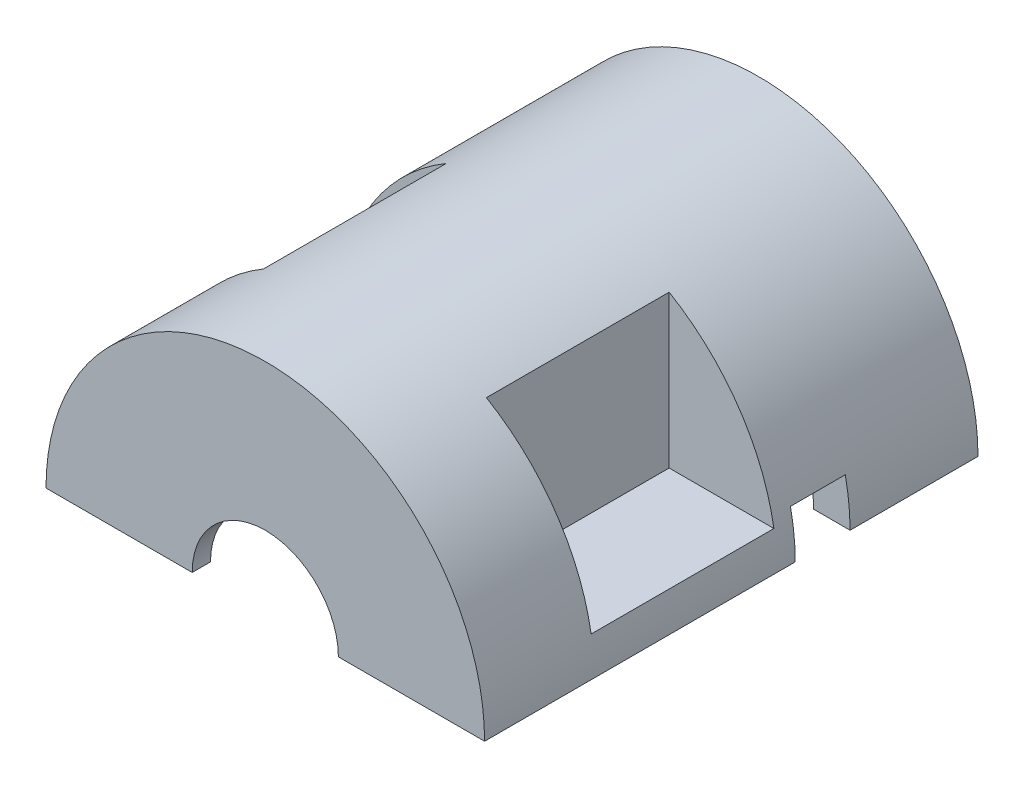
ISO-10303-21;
HEADER;
FILE_DESCRIPTION(('STEP AP214'),'2;1');
FILE_NAME('part.step','',(''),(''),'','','');
FILE_SCHEMA(('AUTOMOTIVE_DESIGN { 1 0 10303 214 1 1 1 1 }'));
ENDSEC;
DATA;
#1=APPLICATION_CONTEXT('core data for automotive mechanical design processes');
#2=APPLICATION_PROTOCOL_DEFINITION('international standard','automotive_design',2000,#1);
#3=PRODUCT_CONTEXT('',#1,'mechanical');
#4=PRODUCT('Part','Part','',(#3));
#5=PRODUCT_RELATED_PRODUCT_CATEGORY('part','',(#4));
#6=PRODUCT_DEFINITION_FORMATION('','',#4);
#7=PRODUCT_DEFINITION_CONTEXT('part definition',#1,'design');
#8=PRODUCT_DEFINITION('design','',#6,#7);
#9=PRODUCT_DEFINITION_SHAPE('','',#8);
#10=(LENGTH_UNIT() NAMED_UNIT(*) SI_UNIT(.MILLI.,.METRE.));
#11=(NAMED_UNIT(*) PLANE_ANGLE_UNIT() SI_UNIT($,.RADIAN.));
#12=(NAMED_UNIT(*) SI_UNIT($,.STERADIAN.) SOLID_ANGLE_UNIT());
#13=UNCERTAINTY_MEASURE_WITH_UNIT(LENGTH_MEASURE(1.E-05),#10,'distance_accuracy_value','');
#14=(GEOMETRIC_REPRESENTATION_CONTEXT(3) GLOBAL_UNCERTAINTY_ASSIGNED_CONTEXT((#13)) GLOBAL_UNIT_ASSIGNED_CONTEXT((#10,
#11,#12)) REPRESENTATION_CONTEXT('',''));
#15=CARTESIAN_POINT('',(0.,0.,0.));
#16=DIRECTION('',(0.,0.,1.));
#17=DIRECTION('',(1.,0.,0.));
#18=AXIS2_PLACEMENT_3D('',#15,#16,#17);
#19=CARTESIAN_POINT('',(-15.24,0.,0.));
#20=DIRECTION('',(0.,1.,0.));
#21=DIRECTION('',(0.,0.,1.));
#22=AXIS2_PLACEMENT_3D('',#19,#20,#21);
#23=PLANE('',#22);
#24=DIRECTION('',(1.,0.,0.));
#25=VECTOR('',#24,1.);
#26=CARTESIAN_POINT('',(-15.24,0.,12.7));
#27=LINE('',#26,#25);
#28=CARTESIAN_POINT('',(5.207,0.,12.7));
#29=VERTEX_POINT('',#28);
#30=CARTESIAN_POINT('',(15.24,0.,12.7));
#31=VERTEX_POINT('',#30);
#32=EDGE_CURVE('E182',#29,#31,#27,.T.);
#33=ORIENTED_EDGE('',*,*,#32,.T.);
#34=DIRECTION('',(0.,0.,-1.));
#35=VECTOR('',#34,1.);
#36=CARTESIAN_POINT('',(15.24,0.,34.29));
#37=LINE('',#36,#35);
#38=CARTESIAN_POINT('',(15.24,0.,34.29));
#39=VERTEX_POINT('',#38);
#40=EDGE_CURVE('E186',#39,#31,#37,.T.);
#41=ORIENTED_EDGE('',*,*,#40,.F.);
#42=DIRECTION('',(-1.,0.,0.));
#43=VECTOR('',#42,1.);
#44=CARTESIAN_POINT('',(-15.24,0.,34.29));
#45=LINE('',#44,#43);
#46=CARTESIAN_POINT('',(5.08,0.,34.29));
#47=VERTEX_POINT('',#46);
#48=EDGE_CURVE('E352',#39,#47,#45,.T.);
#49=ORIENTED_EDGE('',*,*,#48,.T.);
#50=DIRECTION('',(0.,0.,-1.));
#51=VECTOR('',#50,1.);
#52=CARTESIAN_POINT('',(5.08,0.,-2.01673929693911));
#53=LINE('',#52,#51);
#54=CARTESIAN_POINT('',(5.08,0.,33.02));
#55=VERTEX_POINT('',#54);
#56=EDGE_CURVE('E250',#47,#55,#53,.T.);
#57=ORIENTED_EDGE('',*,*,#56,.T.);
#58=DIRECTION('',(1.,0.,0.));
#59=VECTOR('',#58,1.);
#60=CARTESIAN_POINT('',(-15.24,0.,33.02));
#61=LINE('',#60,#59);
#62=CARTESIAN_POINT('',(7.9375,0.,33.02));
#63=VERTEX_POINT('',#62);
#64=EDGE_CURVE('E242',#55,#63,#61,.T.);
#65=ORIENTED_EDGE('',*,*,#64,.T.);
#66=DIRECTION('',(0.,0.,-1.));
#67=VECTOR('',#66,1.);
#68=CARTESIAN_POINT('',(7.9375,0.,-2.01673929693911));
#69=LINE('',#68,#67);
#70=CARTESIAN_POINT('',(7.9375,0.,27.94));
#71=VERTEX_POINT('',#70);
#72=EDGE_CURVE('E247',#63,#71,#69,.T.);
#73=ORIENTED_EDGE('',*,*,#72,.T.);
#74=DIRECTION('',(-1.,0.,0.));
#75=VECTOR('',#74,1.);
#76=CARTESIAN_POINT('',(-15.24,0.,27.94));
#77=LINE('',#76,#75);
#78=CARTESIAN_POINT('',(5.207,0.,27.94));
#79=VERTEX_POINT('',#78);
#80=EDGE_CURVE('E235',#71,#79,#77,.T.);
#81=ORIENTED_EDGE('',*,*,#80,.T.);
#82=DIRECTION('',(0.,0.,-1.));
#83=VECTOR('',#82,1.);
#84=CARTESIAN_POINT('',(5.207,0.,-2.01673929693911));
#85=LINE('',#84,#83);
#86=EDGE_CURVE('E189',#79,#29,#85,.T.);
#87=ORIENTED_EDGE('',*,*,#86,.T.);
#88=EDGE_LOOP('',(#33,#41,#49,#57,#65,#73,#81,#87));
#89=FACE_BOUND('',#88,.T.);
#90=ADVANCED_FACE('F33',(#89),#23,.F.);
#91=DIRECTION('',(0.,0.,1.));
#92=VECTOR('',#91,1.);
#93=CARTESIAN_POINT('',(-15.24,0.,0.));
#94=LINE('',#93,#92);
#95=CARTESIAN_POINT('',(-15.24,0.,12.7));
#96=VERTEX_POINT('',#95);
#97=CARTESIAN_POINT('',(-15.24,0.,34.29));
#98=VERTEX_POINT('',#97);
#99=EDGE_CURVE('E353',#96,#98,#94,.T.);
#100=ORIENTED_EDGE('',*,*,#99,.F.);
#101=CARTESIAN_POINT('',(-5.207,0.,12.7));
#102=VERTEX_POINT('',#101);
#103=EDGE_CURVE('E194',#96,#102,#27,.T.);
#104=ORIENTED_EDGE('',*,*,#103,.T.);
#105=DIRECTION('',(0.,0.,-1.));
#106=VECTOR('',#105,1.);
#107=CARTESIAN_POINT('',(-5.207,0.,-2.01673929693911));
#108=LINE('',#107,#106);
#109=CARTESIAN_POINT('',(-5.207,0.,27.94));
#110=VERTEX_POINT('',#109);
#111=EDGE_CURVE('E228',#102,#110,#108,.F.);
#112=ORIENTED_EDGE('',*,*,#111,.T.);
#113=CARTESIAN_POINT('',(-7.9375,0.,27.94));
#114=VERTEX_POINT('',#113);
#115=EDGE_CURVE('E231',#110,#114,#77,.T.);
#116=ORIENTED_EDGE('',*,*,#115,.T.);
#117=DIRECTION('',(0.,0.,-1.));
#118=VECTOR('',#117,1.);
#119=CARTESIAN_POINT('',(-7.9375,0.,-2.01673929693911));
#120=LINE('',#119,#118);
#121=CARTESIAN_POINT('',(-7.9375,0.,33.02));
#122=VERTEX_POINT('',#121);
#123=EDGE_CURVE('E234',#114,#122,#120,.F.);
#124=ORIENTED_EDGE('',*,*,#123,.T.);
#125=CARTESIAN_POINT('',(-5.08,0.,33.02));
#126=VERTEX_POINT('',#125);
#127=EDGE_CURVE('E238',#122,#126,#61,.T.);
#128=ORIENTED_EDGE('',*,*,#127,.T.);
#129=DIRECTION('',(0.,0.,-1.));
#130=VECTOR('',#129,1.);
#131=CARTESIAN_POINT('',(-5.08,0.,-2.01673929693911));
#132=LINE('',#131,#130);
#133=CARTESIAN_POINT('',(-5.08,0.,34.29));
#134=VERTEX_POINT('',#133);
#135=EDGE_CURVE('E241',#126,#134,#132,.F.);
#136=ORIENTED_EDGE('',*,*,#135,.T.);
#137=EDGE_CURVE('E351',#134,#98,#45,.T.);
#138=ORIENTED_EDGE('',*,*,#137,.T.);
#139=EDGE_LOOP('',(#100,#104,#112,#116,#124,#128,#136,#138));
#140=FACE_BOUND('',#139,.T.);
#141=ADVANCED_FACE('F358',(#140),#23,.F.);
#142=CARTESIAN_POINT('',(15.24,0.,8.89));
#143=VERTEX_POINT('',#142);
#144=CARTESIAN_POINT('',(15.24,0.,0.));
#145=VERTEX_POINT('',#144);
#146=EDGE_CURVE('E211',#143,#145,#37,.T.);
#147=ORIENTED_EDGE('',*,*,#146,.F.);
#148=DIRECTION('',(1.,0.,0.));
#149=VECTOR('',#148,1.);
#150=CARTESIAN_POINT('',(-15.24,0.,8.89));
#151=LINE('',#150,#149);
#152=CARTESIAN_POINT('',(12.7,0.,8.89));
#153=VERTEX_POINT('',#152);
#154=EDGE_CURVE('E287',#153,#143,#151,.T.);
#155=ORIENTED_EDGE('',*,*,#154,.F.);
#156=DIRECTION('',(0.,0.,-1.));
#157=VECTOR('',#156,1.);
#158=CARTESIAN_POINT('',(12.7,0.,-2.01673929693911));
#159=LINE('',#158,#157);
#160=CARTESIAN_POINT('',(12.7,0.,0.));
#161=VERTEX_POINT('',#160);
#162=EDGE_CURVE('E192',#153,#161,#159,.T.);
#163=ORIENTED_EDGE('',*,*,#162,.T.);
#164=DIRECTION('',(-1.,0.,0.));
#165=VECTOR('',#164,1.);
#166=CARTESIAN_POINT('',(0.,0.,0.));
#167=LINE('',#166,#165);
#168=EDGE_CURVE('E221',#145,#161,#167,.T.);
#169=ORIENTED_EDGE('',*,*,#168,.F.);
#170=EDGE_LOOP('',(#147,#155,#163,#169));
#171=FACE_BOUND('',#170,.T.);
#172=ADVANCED_FACE('F291',(#171),#23,.F.);
#173=CARTESIAN_POINT('',(0.,0.,34.29));
#174=DIRECTION('',(0.,0.,-1.));
#175=DIRECTION('',(-1.,0.,0.));
#176=AXIS2_PLACEMENT_3D('',#173,#174,#175);
#177=CYLINDRICAL_SURFACE('',#176,15.24);
#178=DIRECTION('',(0.,0.,-1.));
#179=VECTOR('',#178,1.);
#180=CARTESIAN_POINT('',(-7.747,13.1240843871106,34.29));
#181=LINE('',#180,#179);
#182=CARTESIAN_POINT('',(-7.747,13.1240843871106,13.97));
#183=VERTEX_POINT('',#182);
#184=CARTESIAN_POINT('',(-7.747,13.1240843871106,26.67));
#185=VERTEX_POINT('',#184);
#186=EDGE_CURVE('E270',#183,#185,#181,.F.);
#187=ORIENTED_EDGE('',*,*,#186,.T.);
#188=CARTESIAN_POINT('',(0.,0.,26.67));
#189=DIRECTION('',(0.,0.,1.));
#190=DIRECTION('',(1.,0.,0.));
#191=AXIS2_PLACEMENT_3D('',#188,#189,#190);
#192=CIRCLE('',#191,15.24);
#193=CARTESIAN_POINT('',(-15.026842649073,2.54,26.67));
#194=VERTEX_POINT('',#193);
#195=EDGE_CURVE('E273',#185,#194,#192,.T.);
#196=ORIENTED_EDGE('',*,*,#195,.T.);
#197=DIRECTION('',(0.,0.,-1.));
#198=VECTOR('',#197,1.);
#199=CARTESIAN_POINT('',(-15.026842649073,2.54,34.29));
#200=LINE('',#199,#198);
#201=CARTESIAN_POINT('',(-15.026842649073,2.54,13.97));
#202=VERTEX_POINT('',#201);
#203=EDGE_CURVE('E264',#194,#202,#200,.T.);
#204=ORIENTED_EDGE('',*,*,#203,.T.);
#205=CARTESIAN_POINT('',(0.,0.,13.97));
#206=DIRECTION('',(0.,0.,-1.));
#207=DIRECTION('',(-1.,0.,0.));
#208=AXIS2_PLACEMENT_3D('',#205,#206,#207);
#209=CIRCLE('',#208,15.24);
#210=EDGE_CURVE('E267',#202,#183,#209,.T.);
#211=ORIENTED_EDGE('',*,*,#210,.T.);
#212=EDGE_LOOP('',(#187,#196,#204,#211));
#213=FACE_BOUND('',#212,.T.);
#214=DIRECTION('',(0.,0.,-1.));
#215=VECTOR('',#214,1.);
#216=CARTESIAN_POINT('',(7.747,13.1240843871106,34.29));
#217=LINE('',#216,#215);
#218=CARTESIAN_POINT('',(7.747,13.1240843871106,26.67));
#219=VERTEX_POINT('',#218);
#220=CARTESIAN_POINT('',(7.747,13.1240843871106,13.97));
#221=VERTEX_POINT('',#220);
#222=EDGE_CURVE('E258',#219,#221,#217,.T.);
#223=ORIENTED_EDGE('',*,*,#222,.T.);
#224=CARTESIAN_POINT('',(0.,0.,13.97));
#225=DIRECTION('',(0.,0.,-1.));
#226=DIRECTION('',(-1.,0.,0.));
#227=AXIS2_PLACEMENT_3D('',#224,#225,#226);
#228=CIRCLE('',#227,15.24);
#229=CARTESIAN_POINT('',(15.026842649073,2.54,13.97));
#230=VERTEX_POINT('',#229);
#231=EDGE_CURVE('E261',#221,#230,#228,.T.);
#232=ORIENTED_EDGE('',*,*,#231,.T.);
#233=DIRECTION('',(0.,0.,-1.));
#234=VECTOR('',#233,1.);
#235=CARTESIAN_POINT('',(15.026842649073,2.54,34.29));
#236=LINE('',#235,#234);
#237=CARTESIAN_POINT('',(15.026842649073,2.54,26.67));
#238=VERTEX_POINT('',#237);
#239=EDGE_CURVE('E253',#238,#230,#236,.T.);
#240=ORIENTED_EDGE('',*,*,#239,.F.);
#241=CARTESIAN_POINT('',(0.,0.,26.67));
#242=DIRECTION('',(0.,0.,1.));
#243=DIRECTION('',(1.,0.,0.));
#244=AXIS2_PLACEMENT_3D('',#241,#242,#243);
#245=CIRCLE('',#244,15.24);
#246=EDGE_CURVE('E255',#238,#219,#245,.T.);
#247=ORIENTED_EDGE('',*,*,#246,.T.);
#248=EDGE_LOOP('',(#223,#232,#240,#247));
#249=FACE_BOUND('',#248,.T.);
#250=DIRECTION('',(0.,0.,-1.));
#251=VECTOR('',#250,1.);
#252=CARTESIAN_POINT('',(-14.905602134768,3.175,34.29));
#253=LINE('',#252,#251);
#254=CARTESIAN_POINT('',(-14.905602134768,3.175,8.89));
#255=VERTEX_POINT('',#254);
#256=CARTESIAN_POINT('',(-14.905602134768,3.175,12.7));
#257=VERTEX_POINT('',#256);
#258=EDGE_CURVE('E301',#255,#257,#253,.F.);
#259=ORIENTED_EDGE('',*,*,#258,.T.);
#260=CARTESIAN_POINT('',(0.,0.,12.7));
#261=DIRECTION('',(0.,0.,1.));
#262=DIRECTION('',(1.,0.,0.));
#263=AXIS2_PLACEMENT_3D('',#260,#261,#262);
#264=CIRCLE('',#263,15.24);
#265=EDGE_CURVE('E204',#257,#96,#264,.T.);
#266=ORIENTED_EDGE('',*,*,#265,.T.);
#267=ORIENTED_EDGE('',*,*,#99,.T.);
#268=CARTESIAN_POINT('',(0.,0.,34.29));
#269=DIRECTION('',(0.,0.,1.));
#270=DIRECTION('',(1.,0.,0.));
#271=AXIS2_PLACEMENT_3D('',#268,#269,#270);
#272=CIRCLE('',#271,15.24);
#273=EDGE_CURVE('E209',#39,#98,#272,.T.);
#274=ORIENTED_EDGE('',*,*,#273,.F.);
#275=ORIENTED_EDGE('',*,*,#40,.T.);
#276=CARTESIAN_POINT('',(14.905602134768,3.175,12.7));
#277=VERTEX_POINT('',#276);
#278=EDGE_CURVE('E197',#31,#277,#264,.T.);
#279=ORIENTED_EDGE('',*,*,#278,.T.);
#280=DIRECTION('',(0.,0.,-1.));
#281=VECTOR('',#280,1.);
#282=CARTESIAN_POINT('',(14.905602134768,3.175,34.29));
#283=LINE('',#282,#281);
#284=CARTESIAN_POINT('',(14.905602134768,3.175,8.89));
#285=VERTEX_POINT('',#284);
#286=EDGE_CURVE('E303',#277,#285,#283,.T.);
#287=ORIENTED_EDGE('',*,*,#286,.T.);
#288=CARTESIAN_POINT('',(0.,0.,8.89));
#289=DIRECTION('',(0.,0.,-1.));
#290=DIRECTION('',(-1.,0.,0.));
#291=AXIS2_PLACEMENT_3D('',#288,#289,#290);
#292=CIRCLE('',#291,15.24);
#293=EDGE_CURVE('E297',#285,#143,#292,.T.);
#294=ORIENTED_EDGE('',*,*,#293,.T.);
#295=ORIENTED_EDGE('',*,*,#146,.T.);
#296=CARTESIAN_POINT('',(0.,0.,0.));
#297=DIRECTION('',(0.,0.,1.));
#298=DIRECTION('',(1.,0.,0.));
#299=AXIS2_PLACEMENT_3D('',#296,#297,#298);
#300=CIRCLE('',#299,15.24);
#301=CARTESIAN_POINT('',(-15.24,0.,0.));
#302=VERTEX_POINT('',#301);
#303=EDGE_CURVE('E210',#145,#302,#300,.T.);
#304=ORIENTED_EDGE('',*,*,#303,.T.);
#305=CARTESIAN_POINT('',(-15.24,0.,8.89));
#306=VERTEX_POINT('',#305);
#307=EDGE_CURVE('E215',#302,#306,#94,.T.);
#308=ORIENTED_EDGE('',*,*,#307,.T.);
#309=EDGE_CURVE('E299',#306,#255,#292,.T.);
#310=ORIENTED_EDGE('',*,*,#309,.T.);
#311=EDGE_LOOP('',(#259,#266,#267,#274,#275,#279,#287,#294,#295,#304,#308,#310));
#312=FACE_BOUND('',#311,.T.);
#313=ADVANCED_FACE('F35',(#213,#249,#312),#177,.T.);
#314=CARTESIAN_POINT('',(0.,0.,34.29));
#315=DIRECTION('',(0.,0.,1.));
#316=DIRECTION('',(1.,0.,0.));
#317=AXIS2_PLACEMENT_3D('',#314,#315,#316);
#318=PLANE('',#317);
#319=CARTESIAN_POINT('',(0.,0.,34.29));
#320=DIRECTION('',(0.,0.,-1.));
#321=DIRECTION('',(-1.,0.,0.));
#322=AXIS2_PLACEMENT_3D('',#319,#320,#321);
#323=CIRCLE('',#322,5.08);
#324=EDGE_CURVE('E349',#134,#47,#323,.T.);
#325=ORIENTED_EDGE('',*,*,#324,.T.);
#326=ORIENTED_EDGE('',*,*,#48,.F.);
#327=ORIENTED_EDGE('',*,*,#273,.T.);
#328=ORIENTED_EDGE('',*,*,#137,.F.);
#329=EDGE_LOOP('',(#325,#326,#327,#328));
#330=FACE_BOUND('',#329,.T.);
#331=ADVANCED_FACE('F360',(#330),#318,.T.);
#332=CARTESIAN_POINT('',(0.,0.,0.));
#333=DIRECTION('',(0.,0.,1.));
#334=DIRECTION('',(1.,0.,0.));
#335=AXIS2_PLACEMENT_3D('',#332,#333,#334);
#336=PLANE('',#335);
#337=ORIENTED_EDGE('',*,*,#168,.T.);
#338=CARTESIAN_POINT('',(0.,0.,0.));
#339=DIRECTION('',(0.,0.,-1.));
#340=DIRECTION('',(-1.,0.,0.));
#341=AXIS2_PLACEMENT_3D('',#338,#339,#340);
#342=CIRCLE('',#341,12.7);
#343=CARTESIAN_POINT('',(-12.7,0.,0.));
#344=VERTEX_POINT('',#343);
#345=EDGE_CURVE('E319',#344,#161,#342,.T.);
#346=ORIENTED_EDGE('',*,*,#345,.F.);
#347=EDGE_CURVE('E219',#344,#302,#167,.T.);
#348=ORIENTED_EDGE('',*,*,#347,.T.);
#349=ORIENTED_EDGE('',*,*,#303,.F.);
#350=EDGE_LOOP('',(#337,#346,#348,#349));
#351=FACE_BOUND('',#350,.T.);
#352=ADVANCED_FACE('F391',(#351),#336,.F.);
#353=DIRECTION('',(0.,0.,-1.));
#354=VECTOR('',#353,1.);
#355=CARTESIAN_POINT('',(-12.7,0.,-2.01673929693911));
#356=LINE('',#355,#354);
#357=CARTESIAN_POINT('',(-12.7,0.,8.89));
#358=VERTEX_POINT('',#357);
#359=EDGE_CURVE('E224',#344,#358,#356,.F.);
#360=ORIENTED_EDGE('',*,*,#359,.T.);
#361=EDGE_CURVE('E56',#306,#358,#151,.T.);
#362=ORIENTED_EDGE('',*,*,#361,.F.);
#363=ORIENTED_EDGE('',*,*,#307,.F.);
#364=ORIENTED_EDGE('',*,*,#347,.F.);
#365=EDGE_LOOP('',(#360,#362,#363,#364));
#366=FACE_BOUND('',#365,.T.);
#367=ADVANCED_FACE('F395',(#366),#23,.F.);
#368=CARTESIAN_POINT('',(0.,0.,-2.01673929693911));
#369=DIRECTION('',(0.,0.,-1.));
#370=DIRECTION('',(-1.,0.,0.));
#371=AXIS2_PLACEMENT_3D('',#368,#369,#370);
#372=CYLINDRICAL_SURFACE('',#371,5.08);
#373=ORIENTED_EDGE('',*,*,#324,.F.);
#374=ORIENTED_EDGE('',*,*,#135,.F.);
#375=CARTESIAN_POINT('',(0.,0.,33.02));
#376=DIRECTION('',(0.,0.,-1.));
#377=DIRECTION('',(-1.,0.,0.));
#378=AXIS2_PLACEMENT_3D('',#375,#376,#377);
#379=CIRCLE('',#378,5.08);
#380=EDGE_CURVE('E346',#126,#55,#379,.T.);
#381=ORIENTED_EDGE('',*,*,#380,.T.);
#382=ORIENTED_EDGE('',*,*,#56,.F.);
#383=EDGE_LOOP('',(#373,#374,#381,#382));
#384=FACE_BOUND('',#383,.T.);
#385=ADVANCED_FACE('F362',(#384),#372,.F.);
#386=CARTESIAN_POINT('',(5.08,0.,33.02));
#387=DIRECTION('',(0.,0.,1.));
#388=DIRECTION('',(1.,0.,0.));
#389=AXIS2_PLACEMENT_3D('',#386,#387,#388);
#390=PLANE('',#389);
#391=CARTESIAN_POINT('',(0.,0.,33.02));
#392=DIRECTION('',(0.,0.,-1.));
#393=DIRECTION('',(-1.,0.,0.));
#394=AXIS2_PLACEMENT_3D('',#391,#392,#393);
#395=CIRCLE('',#394,7.9375);
#396=EDGE_CURVE('E343',#122,#63,#395,.T.);
#397=ORIENTED_EDGE('',*,*,#396,.T.);
#398=ORIENTED_EDGE('',*,*,#64,.F.);
#399=ORIENTED_EDGE('',*,*,#380,.F.);
#400=ORIENTED_EDGE('',*,*,#127,.F.);
#401=EDGE_LOOP('',(#397,#398,#399,#400));
#402=FACE_BOUND('',#401,.T.);
#403=ADVANCED_FACE('F366',(#402),#390,.F.);
#404=CARTESIAN_POINT('',(0.,0.,-2.01673929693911));
#405=DIRECTION('',(0.,0.,-1.));
#406=DIRECTION('',(-1.,0.,0.));
#407=AXIS2_PLACEMENT_3D('',#404,#405,#406);
#408=CYLINDRICAL_SURFACE('',#407,7.9375);
#409=ORIENTED_EDGE('',*,*,#396,.F.);
#410=ORIENTED_EDGE('',*,*,#123,.F.);
#411=CARTESIAN_POINT('',(0.,0.,27.94));
#412=DIRECTION('',(0.,0.,-1.));
#413=DIRECTION('',(-1.,0.,0.));
#414=AXIS2_PLACEMENT_3D('',#411,#412,#413);
#415=CIRCLE('',#414,7.9375);
#416=EDGE_CURVE('E340',#114,#71,#415,.T.);
#417=ORIENTED_EDGE('',*,*,#416,.T.);
#418=ORIENTED_EDGE('',*,*,#72,.F.);
#419=EDGE_LOOP('',(#409,#410,#417,#418));
#420=FACE_BOUND('',#419,.T.);
#421=ADVANCED_FACE('F369',(#420),#408,.F.);
#422=CARTESIAN_POINT('',(7.9375,0.,27.94));
#423=DIRECTION('',(0.,0.,-1.));
#424=DIRECTION('',(-1.,0.,0.));
#425=AXIS2_PLACEMENT_3D('',#422,#423,#424);
#426=PLANE('',#425);
#427=ORIENTED_EDGE('',*,*,#416,.F.);
#428=ORIENTED_EDGE('',*,*,#115,.F.);
#429=CARTESIAN_POINT('',(0.,0.,27.94));
#430=DIRECTION('',(0.,0.,-1.));
#431=DIRECTION('',(-1.,0.,0.));
#432=AXIS2_PLACEMENT_3D('',#429,#430,#431);
#433=CIRCLE('',#432,5.207);
#434=EDGE_CURVE('E337',#110,#79,#433,.T.);
#435=ORIENTED_EDGE('',*,*,#434,.T.);
#436=ORIENTED_EDGE('',*,*,#80,.F.);
#437=EDGE_LOOP('',(#427,#428,#435,#436));
#438=FACE_BOUND('',#437,.T.);
#439=ADVANCED_FACE('F373',(#438),#426,.F.);
#440=CARTESIAN_POINT('',(0.,0.,-2.01673929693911));
#441=DIRECTION('',(0.,0.,-1.));
#442=DIRECTION('',(-1.,0.,0.));
#443=AXIS2_PLACEMENT_3D('',#440,#441,#442);
#444=CYLINDRICAL_SURFACE('',#443,5.207);
#445=ORIENTED_EDGE('',*,*,#434,.F.);
#446=ORIENTED_EDGE('',*,*,#111,.F.);
#447=CARTESIAN_POINT('',(0.,0.,12.7));
#448=DIRECTION('',(0.,0.,-1.));
#449=DIRECTION('',(-1.,0.,0.));
#450=AXIS2_PLACEMENT_3D('',#447,#448,#449);
#451=CIRCLE('',#450,5.207);
#452=EDGE_CURVE('E335',#102,#29,#451,.T.);
#453=ORIENTED_EDGE('',*,*,#452,.T.);
#454=ORIENTED_EDGE('',*,*,#86,.F.);
#455=EDGE_LOOP('',(#445,#446,#453,#454));
#456=FACE_BOUND('',#455,.T.);
#457=ADVANCED_FACE('F375',(#456),#444,.F.);
#458=CARTESIAN_POINT('',(5.207,0.,12.7));
#459=DIRECTION('',(0.,0.,1.));
#460=DIRECTION('',(1.,0.,0.));
#461=AXIS2_PLACEMENT_3D('',#458,#459,#460);
#462=PLANE('',#461);
#463=CARTESIAN_POINT('',(0.,0.,12.7));
#464=DIRECTION('',(0.,0.,-1.));
#465=DIRECTION('',(-1.,0.,0.));
#466=AXIS2_PLACEMENT_3D('',#463,#464,#465);
#467=CIRCLE('',#466,12.7);
#468=CARTESIAN_POINT('',(-12.2967221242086,3.175,12.7));
#469=VERTEX_POINT('',#468);
#470=CARTESIAN_POINT('',(12.2967221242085,3.175,12.7));
#471=VERTEX_POINT('',#470);
#472=EDGE_CURVE('E333',#469,#471,#467,.T.);
#473=ORIENTED_EDGE('',*,*,#472,.T.);
#474=DIRECTION('',(1.,0.,0.));
#475=VECTOR('',#474,1.);
#476=CARTESIAN_POINT('',(-15.24,3.175,12.7));
#477=LINE('',#476,#475);
#478=EDGE_CURVE('E200',#471,#277,#477,.T.);
#479=ORIENTED_EDGE('',*,*,#478,.T.);
#480=ORIENTED_EDGE('',*,*,#278,.F.);
#481=ORIENTED_EDGE('',*,*,#32,.F.);
#482=ORIENTED_EDGE('',*,*,#452,.F.);
#483=ORIENTED_EDGE('',*,*,#103,.F.);
#484=ORIENTED_EDGE('',*,*,#265,.F.);
#485=EDGE_CURVE('E300',#257,#469,#477,.T.);
#486=ORIENTED_EDGE('',*,*,#485,.T.);
#487=EDGE_LOOP('',(#473,#479,#480,#481,#482,#483,#484,#486));
#488=FACE_BOUND('',#487,.T.);
#489=ADVANCED_FACE('F199',(#488),#462,.F.);
#490=CARTESIAN_POINT('',(0.,0.,-2.01673929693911));
#491=DIRECTION('',(0.,0.,-1.));
#492=DIRECTION('',(-1.,0.,0.));
#493=AXIS2_PLACEMENT_3D('',#490,#491,#492);
#494=CYLINDRICAL_SURFACE('',#493,12.7);
#495=CARTESIAN_POINT('',(0.,0.,8.89));
#496=DIRECTION('',(0.,0.,-1.));
#497=DIRECTION('',(-1.,0.,0.));
#498=AXIS2_PLACEMENT_3D('',#495,#496,#497);
#499=CIRCLE('',#498,12.7);
#500=CARTESIAN_POINT('',(12.2967221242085,3.175,8.89));
#501=VERTEX_POINT('',#500);
#502=EDGE_CURVE('E41',#153,#501,#499,.F.);
#503=ORIENTED_EDGE('',*,*,#502,.T.);
#504=DIRECTION('',(0.,0.,-1.));
#505=VECTOR('',#504,1.);
#506=CARTESIAN_POINT('',(12.2967221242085,3.175,-2.01673929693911));
#507=LINE('',#506,#505);
#508=EDGE_CURVE('E11',#501,#471,#507,.F.);
#509=ORIENTED_EDGE('',*,*,#508,.T.);
#510=ORIENTED_EDGE('',*,*,#472,.F.);
#511=DIRECTION('',(0.,0.,-1.));
#512=VECTOR('',#511,1.);
#513=CARTESIAN_POINT('',(-12.2967221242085,3.175,-2.01673929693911));
#514=LINE('',#513,#512);
#515=CARTESIAN_POINT('',(-12.2967221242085,3.175,8.89));
#516=VERTEX_POINT('',#515);
#517=EDGE_CURVE('E277',#469,#516,#514,.T.);
#518=ORIENTED_EDGE('',*,*,#517,.T.);
#519=EDGE_CURVE('E276',#516,#358,#499,.F.);
#520=ORIENTED_EDGE('',*,*,#519,.T.);
#521=ORIENTED_EDGE('',*,*,#359,.F.);
#522=ORIENTED_EDGE('',*,*,#345,.T.);
#523=ORIENTED_EDGE('',*,*,#162,.F.);
#524=EDGE_LOOP('',(#503,#509,#510,#518,#520,#521,#522,#523));
#525=FACE_BOUND('',#524,.T.);
#526=ADVANCED_FACE('F283',(#525),#494,.F.);
#527=CARTESIAN_POINT('',(18.6324299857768,15.24,13.97));
#528=DIRECTION('',(0.,0.,-1.));
#529=DIRECTION('',(-1.,0.,0.));
#530=AXIS2_PLACEMENT_3D('',#527,#528,#529);
#531=PLANE('',#530);
#532=DIRECTION('',(0.,-1.,0.));
#533=VECTOR('',#532,1.);
#534=CARTESIAN_POINT('',(7.747,15.24,13.97));
#535=LINE('',#534,#533);
#536=CARTESIAN_POINT('',(7.747,2.54,13.97));
#537=VERTEX_POINT('',#536);
#538=EDGE_CURVE('E310',#221,#537,#535,.T.);
#539=ORIENTED_EDGE('',*,*,#538,.T.);
#540=DIRECTION('',(1.,0.,0.));
#541=VECTOR('',#540,1.);
#542=CARTESIAN_POINT('',(18.6324299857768,2.54,13.97));
#543=LINE('',#542,#541);
#544=EDGE_CURVE('E326',#537,#230,#543,.T.);
#545=ORIENTED_EDGE('',*,*,#544,.T.);
#546=ORIENTED_EDGE('',*,*,#231,.F.);
#547=EDGE_LOOP('',(#539,#545,#546));
#548=FACE_BOUND('',#547,.T.);
#549=ADVANCED_FACE('F489',(#548),#531,.F.);
#550=CARTESIAN_POINT('',(7.747,15.24,26.67));
#551=DIRECTION('',(-1.,0.,0.));
#552=DIRECTION('',(0.,0.,1.));
#553=AXIS2_PLACEMENT_3D('',#550,#551,#552);
#554=PLANE('',#553);
#555=DIRECTION('',(0.,-1.,0.));
#556=VECTOR('',#555,1.);
#557=CARTESIAN_POINT('',(7.747,15.24,26.67));
#558=LINE('',#557,#556);
#559=CARTESIAN_POINT('',(7.747,2.54,26.67));
#560=VERTEX_POINT('',#559);
#561=EDGE_CURVE('E329',#219,#560,#558,.T.);
#562=ORIENTED_EDGE('',*,*,#561,.T.);
#563=DIRECTION('',(0.,0.,-1.));
#564=VECTOR('',#563,1.);
#565=CARTESIAN_POINT('',(7.747,2.54,26.67));
#566=LINE('',#565,#564);
#567=EDGE_CURVE('E323',#560,#537,#566,.T.);
#568=ORIENTED_EDGE('',*,*,#567,.T.);
#569=ORIENTED_EDGE('',*,*,#538,.F.);
#570=ORIENTED_EDGE('',*,*,#222,.F.);
#571=EDGE_LOOP('',(#562,#568,#569,#570));
#572=FACE_BOUND('',#571,.T.);
#573=ADVANCED_FACE('F479',(#572),#554,.F.);
#574=CARTESIAN_POINT('',(18.6324299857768,15.24,26.67));
#575=DIRECTION('',(0.,0.,1.));
#576=DIRECTION('',(1.,0.,0.));
#577=AXIS2_PLACEMENT_3D('',#574,#575,#576);
#578=PLANE('',#577);
#579=DIRECTION('',(-1.,0.,0.));
#580=VECTOR('',#579,1.);
#581=CARTESIAN_POINT('',(18.6324299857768,2.54,26.67));
#582=LINE('',#581,#580);
#583=EDGE_CURVE('E203',#238,#560,#582,.T.);
#584=ORIENTED_EDGE('',*,*,#583,.T.);
#585=ORIENTED_EDGE('',*,*,#561,.F.);
#586=ORIENTED_EDGE('',*,*,#246,.F.);
#587=EDGE_LOOP('',(#584,#585,#586));
#588=FACE_BOUND('',#587,.T.);
#589=ADVANCED_FACE('F469',(#588),#578,.F.);
#590=CARTESIAN_POINT('',(0.,2.54,0.));
#591=DIRECTION('',(0.,1.,0.));
#592=DIRECTION('',(0.,0.,1.));
#593=AXIS2_PLACEMENT_3D('',#590,#591,#592);
#594=PLANE('',#593);
#595=ORIENTED_EDGE('',*,*,#239,.T.);
#596=ORIENTED_EDGE('',*,*,#544,.F.);
#597=ORIENTED_EDGE('',*,*,#567,.F.);
#598=ORIENTED_EDGE('',*,*,#583,.F.);
#599=EDGE_LOOP('',(#595,#596,#597,#598));
#600=FACE_BOUND('',#599,.T.);
#601=ADVANCED_FACE('F459',(#600),#594,.T.);
#602=CARTESIAN_POINT('',(-18.6324299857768,15.24,26.67));
#603=DIRECTION('',(0.,0.,1.));
#604=DIRECTION('',(1.,0.,0.));
#605=AXIS2_PLACEMENT_3D('',#602,#603,#604);
#606=PLANE('',#605);
#607=DIRECTION('',(0.,-1.,0.));
#608=VECTOR('',#607,1.);
#609=CARTESIAN_POINT('',(-7.747,15.24,26.67));
#610=LINE('',#609,#608);
#611=CARTESIAN_POINT('',(-7.747,2.54,26.67));
#612=VERTEX_POINT('',#611);
#613=EDGE_CURVE('E317',#185,#612,#610,.T.);
#614=ORIENTED_EDGE('',*,*,#613,.T.);
#615=DIRECTION('',(-1.,0.,0.));
#616=VECTOR('',#615,1.);
#617=CARTESIAN_POINT('',(-18.6324299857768,2.54,26.67));
#618=LINE('',#617,#616);
#619=EDGE_CURVE('E313',#612,#194,#618,.T.);
#620=ORIENTED_EDGE('',*,*,#619,.T.);
#621=ORIENTED_EDGE('',*,*,#195,.F.);
#622=EDGE_LOOP('',(#614,#620,#621));
#623=FACE_BOUND('',#622,.T.);
#624=ADVANCED_FACE('F449',(#623),#606,.F.);
#625=CARTESIAN_POINT('',(-7.747,15.24,26.67));
#626=DIRECTION('',(1.,0.,0.));
#627=DIRECTION('',(0.,0.,-1.));
#628=AXIS2_PLACEMENT_3D('',#625,#626,#627);
#629=PLANE('',#628);
#630=DIRECTION('',(0.,-1.,0.));
#631=VECTOR('',#630,1.);
#632=CARTESIAN_POINT('',(-7.747,15.24,13.97));
#633=LINE('',#632,#631);
#634=CARTESIAN_POINT('',(-7.747,2.54,13.97));
#635=VERTEX_POINT('',#634);
#636=EDGE_CURVE('E316',#183,#635,#633,.T.);
#637=ORIENTED_EDGE('',*,*,#636,.T.);
#638=DIRECTION('',(0.,0.,1.));
#639=VECTOR('',#638,1.);
#640=CARTESIAN_POINT('',(-7.747,2.54,26.67));
#641=LINE('',#640,#639);
#642=EDGE_CURVE('E309',#635,#612,#641,.T.);
#643=ORIENTED_EDGE('',*,*,#642,.T.);
#644=ORIENTED_EDGE('',*,*,#613,.F.);
#645=ORIENTED_EDGE('',*,*,#186,.F.);
#646=EDGE_LOOP('',(#637,#643,#644,#645));
#647=FACE_BOUND('',#646,.T.);
#648=ADVANCED_FACE('F439',(#647),#629,.F.);
#649=CARTESIAN_POINT('',(-18.6324299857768,15.24,13.97));
#650=DIRECTION('',(0.,0.,-1.));
#651=DIRECTION('',(-1.,0.,0.));
#652=AXIS2_PLACEMENT_3D('',#649,#650,#651);
#653=PLANE('',#652);
#654=DIRECTION('',(1.,0.,0.));
#655=VECTOR('',#654,1.);
#656=CARTESIAN_POINT('',(-18.6324299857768,2.54,13.97));
#657=LINE('',#656,#655);
#658=EDGE_CURVE('E306',#202,#635,#657,.T.);
#659=ORIENTED_EDGE('',*,*,#658,.T.);
#660=ORIENTED_EDGE('',*,*,#636,.F.);
#661=ORIENTED_EDGE('',*,*,#210,.F.);
#662=EDGE_LOOP('',(#659,#660,#661));
#663=FACE_BOUND('',#662,.T.);
#664=ADVANCED_FACE('F428',(#663),#653,.F.);
#665=CARTESIAN_POINT('',(0.,2.54,0.));
#666=DIRECTION('',(0.,-1.,0.));
#667=DIRECTION('',(0.,0.,-1.));
#668=AXIS2_PLACEMENT_3D('',#665,#666,#667);
#669=PLANE('',#668);
#670=ORIENTED_EDGE('',*,*,#619,.F.);
#671=ORIENTED_EDGE('',*,*,#642,.F.);
#672=ORIENTED_EDGE('',*,*,#658,.F.);
#673=ORIENTED_EDGE('',*,*,#203,.F.);
#674=EDGE_LOOP('',(#670,#671,#672,#673));
#675=FACE_BOUND('',#674,.T.);
#676=ADVANCED_FACE('F423',(#675),#669,.F.);
#677=CARTESIAN_POINT('',(-15.24,0.,8.89));
#678=DIRECTION('',(0.,0.,-1.));
#679=DIRECTION('',(-1.,0.,0.));
#680=AXIS2_PLACEMENT_3D('',#677,#678,#679);
#681=PLANE('',#680);
#682=ORIENTED_EDGE('',*,*,#361,.T.);
#683=ORIENTED_EDGE('',*,*,#519,.F.);
#684=DIRECTION('',(1.,0.,0.));
#685=VECTOR('',#684,1.);
#686=CARTESIAN_POINT('',(-15.24,3.175,8.89));
#687=LINE('',#686,#685);
#688=EDGE_CURVE('E384',#255,#516,#687,.T.);
#689=ORIENTED_EDGE('',*,*,#688,.F.);
#690=ORIENTED_EDGE('',*,*,#309,.F.);
#691=EDGE_LOOP('',(#682,#683,#689,#690));
#692=FACE_BOUND('',#691,.T.);
#693=ADVANCED_FACE('F385',(#692),#681,.F.);
#694=CARTESIAN_POINT('',(-15.24,3.175,12.7));
#695=DIRECTION('',(0.,1.,0.));
#696=DIRECTION('',(0.,0.,1.));
#697=AXIS2_PLACEMENT_3D('',#694,#695,#696);
#698=PLANE('',#697);
#699=ORIENTED_EDGE('',*,*,#688,.T.);
#700=ORIENTED_EDGE('',*,*,#517,.F.);
#701=ORIENTED_EDGE('',*,*,#485,.F.);
#702=ORIENTED_EDGE('',*,*,#258,.F.);
#703=EDGE_LOOP('',(#699,#700,#701,#702));
#704=FACE_BOUND('',#703,.T.);
#705=ADVANCED_FACE('F383',(#704),#698,.F.);
#706=ORIENTED_EDGE('',*,*,#478,.F.);
#707=ORIENTED_EDGE('',*,*,#508,.F.);
#708=EDGE_CURVE('E48',#501,#285,#687,.T.);
#709=ORIENTED_EDGE('',*,*,#708,.T.);
#710=ORIENTED_EDGE('',*,*,#286,.F.);
#711=EDGE_LOOP('',(#706,#707,#709,#710));
#712=FACE_BOUND('',#711,.T.);
#713=ADVANCED_FACE('F387',(#712),#698,.F.);
#714=ORIENTED_EDGE('',*,*,#708,.F.);
#715=ORIENTED_EDGE('',*,*,#502,.F.);
#716=ORIENTED_EDGE('',*,*,#154,.T.);
#717=ORIENTED_EDGE('',*,*,#293,.F.);
#718=EDGE_LOOP('',(#714,#715,#716,#717));
#719=FACE_BOUND('',#718,.T.);
#720=ADVANCED_FACE('F286',(#719),#681,.F.);
#721=CLOSED_SHELL('',(#90,#141,#172,#313,#331,#352,#367,#385,#403,#421,#439,#457,#489,#526,#549,
#573,#589,#601,#624,#648,#664,#676,#693,#705,#713,#720));
#722=MANIFOLD_SOLID_BREP('B2',#721);
#723=ADVANCED_BREP_SHAPE_REPRESENTATION('',(#18,#722),#14);
#724=SHAPE_DEFINITION_REPRESENTATION(#9,#723);
ENDSEC;
END-ISO-10303-21;
